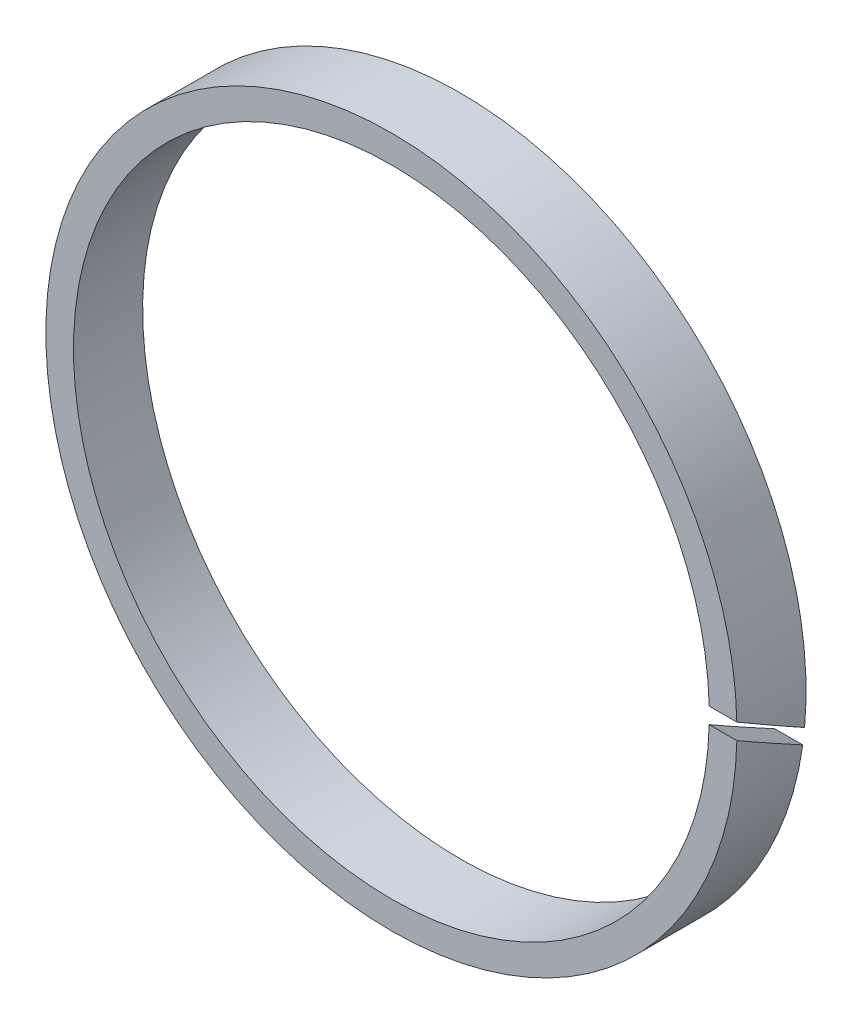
ISO-10303-21;
HEADER;
FILE_DESCRIPTION(('STEP AP214'),'2;1');
FILE_NAME('part.step','',(''),(''),'','','');
FILE_SCHEMA(('AUTOMOTIVE_DESIGN { 1 0 10303 214 1 1 1 1 }'));
ENDSEC;
DATA;
#1=APPLICATION_CONTEXT('core data for automotive mechanical design processes');
#2=APPLICATION_PROTOCOL_DEFINITION('international standard','automotive_design',2000,#1);
#3=PRODUCT_CONTEXT('',#1,'mechanical');
#4=PRODUCT('Part','Part','',(#3));
#5=PRODUCT_RELATED_PRODUCT_CATEGORY('part','',(#4));
#6=PRODUCT_DEFINITION_FORMATION('','',#4);
#7=PRODUCT_DEFINITION_CONTEXT('part definition',#1,'design');
#8=PRODUCT_DEFINITION('design','',#6,#7);
#9=PRODUCT_DEFINITION_SHAPE('','',#8);
#10=(LENGTH_UNIT() NAMED_UNIT(*) SI_UNIT(.MILLI.,.METRE.));
#11=(NAMED_UNIT(*) PLANE_ANGLE_UNIT() SI_UNIT($,.RADIAN.));
#12=(NAMED_UNIT(*) SI_UNIT($,.STERADIAN.) SOLID_ANGLE_UNIT());
#13=UNCERTAINTY_MEASURE_WITH_UNIT(LENGTH_MEASURE(1.E-05),#10,'distance_accuracy_value','');
#14=(GEOMETRIC_REPRESENTATION_CONTEXT(3) GLOBAL_UNCERTAINTY_ASSIGNED_CONTEXT((#13)) GLOBAL_UNIT_ASSIGNED_CONTEXT((#10,
#11,#12)) REPRESENTATION_CONTEXT('',''));
#15=CARTESIAN_POINT('',(0.,0.,0.));
#16=DIRECTION('',(0.,0.,1.));
#17=DIRECTION('',(1.,0.,0.));
#18=AXIS2_PLACEMENT_3D('',#15,#16,#17);
#19=CARTESIAN_POINT('',(0.,0.,-5.));
#20=DIRECTION('',(0.,0.,1.));
#21=DIRECTION('',(1.,0.,0.));
#22=AXIS2_PLACEMENT_3D('',#19,#20,#21);
#23=CYLINDRICAL_SURFACE('',#22,25.);
#24=CARTESIAN_POINT('',(0.,0.,0.999999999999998));
#25=DIRECTION('',(0.,-0.866025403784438,0.500000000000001));
#26=DIRECTION('',(0.,0.500000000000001,0.866025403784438));
#27=AXIS2_PLACEMENT_3D('',#24,#25,#26);
#28=ELLIPSE('',#27,49.9999999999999,25.);
#29=CARTESIAN_POINT('',(24.9933324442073,-0.577350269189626,0.));
#30=VERTEX_POINT('',#29);
#31=CARTESIAN_POINT('',(24.7588368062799,-3.46410161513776,-5.));
#32=VERTEX_POINT('',#31);
#33=EDGE_CURVE('E407',#30,#32,#28,.F.);
#34=ORIENTED_EDGE('',*,*,#33,.F.);
#35=CARTESIAN_POINT('',(0.,0.,0.));
#36=DIRECTION('',(0.,0.,1.));
#37=DIRECTION('',(1.,0.,0.));
#38=AXIS2_PLACEMENT_3D('',#35,#36,#37);
#39=CIRCLE('',#38,25.);
#40=CARTESIAN_POINT('',(24.9933324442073,0.577350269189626,0.));
#41=VERTEX_POINT('',#40);
#42=EDGE_CURVE('E402',#41,#30,#39,.T.);
#43=ORIENTED_EDGE('',*,*,#42,.F.);
#44=CARTESIAN_POINT('',(0.,0.,-0.999999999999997));
#45=DIRECTION('',(0.,0.866025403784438,-0.500000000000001));
#46=DIRECTION('',(0.,0.500000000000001,0.866025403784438));
#47=AXIS2_PLACEMENT_3D('',#44,#45,#46);
#48=ELLIPSE('',#47,49.9999999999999,25.);
#49=CARTESIAN_POINT('',(24.8931048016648,-2.30940107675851,-5.));
#50=VERTEX_POINT('',#49);
#51=EDGE_CURVE('E399',#50,#41,#48,.F.);
#52=ORIENTED_EDGE('',*,*,#51,.F.);
#53=CARTESIAN_POINT('',(0.,0.,-5.));
#54=DIRECTION('',(0.,0.,1.));
#55=DIRECTION('',(1.,0.,0.));
#56=AXIS2_PLACEMENT_3D('',#53,#54,#55);
#57=CIRCLE('',#56,25.);
#58=EDGE_CURVE('E392',#50,#32,#57,.T.);
#59=ORIENTED_EDGE('',*,*,#58,.T.);
#60=EDGE_LOOP('',(#34,#43,#52,#59));
#61=FACE_BOUND('',#60,.T.);
#62=ADVANCED_FACE('F348',(#61),#23,.T.);
#63=CARTESIAN_POINT('',(0.,0.,-5.));
#64=DIRECTION('',(0.,0.,1.));
#65=DIRECTION('',(1.,0.,0.));
#66=AXIS2_PLACEMENT_3D('',#63,#64,#65);
#67=PLANE('',#66);
#68=CARTESIAN_POINT('',(0.,0.,-5.));
#69=DIRECTION('',(0.,0.,1.));
#70=DIRECTION('',(1.,0.,0.));
#71=AXIS2_PLACEMENT_3D('',#68,#69,#70);
#72=CIRCLE('',#71,23.);
#73=CARTESIAN_POINT('',(22.8837642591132,-2.30940107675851,-5.));
#74=VERTEX_POINT('',#73);
#75=CARTESIAN_POINT('',(22.7376340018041,-3.46410161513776,-5.));
#76=VERTEX_POINT('',#75);
#77=EDGE_CURVE('E397',#74,#76,#72,.T.);
#78=ORIENTED_EDGE('',*,*,#77,.T.);
#79=DIRECTION('',(1.,0.,0.));
#80=VECTOR('',#79,1.);
#81=CARTESIAN_POINT('',(0.,-3.46410161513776,-5.));
#82=LINE('',#81,#80);
#83=EDGE_CURVE('E370',#76,#32,#82,.T.);
#84=ORIENTED_EDGE('',*,*,#83,.T.);
#85=ORIENTED_EDGE('',*,*,#58,.F.);
#86=DIRECTION('',(-1.,0.,0.));
#87=VECTOR('',#86,1.);
#88=CARTESIAN_POINT('',(0.,-2.30940107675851,-5.));
#89=LINE('',#88,#87);
#90=EDGE_CURVE('E386',#50,#74,#89,.T.);
#91=ORIENTED_EDGE('',*,*,#90,.T.);
#92=EDGE_LOOP('',(#78,#84,#85,#91));
#93=FACE_BOUND('',#92,.T.);
#94=ADVANCED_FACE('F396',(#93),#67,.F.);
#95=CARTESIAN_POINT('',(0.,0.,0.));
#96=DIRECTION('',(0.,0.,1.));
#97=DIRECTION('',(1.,0.,0.));
#98=AXIS2_PLACEMENT_3D('',#95,#96,#97);
#99=PLANE('',#98);
#100=DIRECTION('',(1.,0.,0.));
#101=VECTOR('',#100,1.);
#102=CARTESIAN_POINT('',(0.,-0.577350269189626,0.));
#103=LINE('',#102,#101);
#104=CARTESIAN_POINT('',(22.9927524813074,-0.577350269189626,0.));
#105=VERTEX_POINT('',#104);
#106=EDGE_CURVE('E414',#105,#30,#103,.T.);
#107=ORIENTED_EDGE('',*,*,#106,.F.);
#108=CARTESIAN_POINT('',(0.,0.,0.));
#109=DIRECTION('',(0.,0.,1.));
#110=DIRECTION('',(1.,0.,0.));
#111=AXIS2_PLACEMENT_3D('',#108,#109,#110);
#112=CIRCLE('',#111,23.);
#113=CARTESIAN_POINT('',(22.9927524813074,0.577350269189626,0.));
#114=VERTEX_POINT('',#113);
#115=EDGE_CURVE('E403',#114,#105,#112,.T.);
#116=ORIENTED_EDGE('',*,*,#115,.F.);
#117=DIRECTION('',(-1.,0.,0.));
#118=VECTOR('',#117,1.);
#119=CARTESIAN_POINT('',(0.,0.577350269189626,0.));
#120=LINE('',#119,#118);
#121=EDGE_CURVE('E362',#41,#114,#120,.T.);
#122=ORIENTED_EDGE('',*,*,#121,.F.);
#123=ORIENTED_EDGE('',*,*,#42,.T.);
#124=EDGE_LOOP('',(#107,#116,#122,#123));
#125=FACE_BOUND('',#124,.T.);
#126=ADVANCED_FACE('F422',(#125),#99,.T.);
#127=CARTESIAN_POINT('',(0.,0.,-5.));
#128=DIRECTION('',(0.,0.,1.));
#129=DIRECTION('',(1.,0.,0.));
#130=AXIS2_PLACEMENT_3D('',#127,#128,#129);
#131=CYLINDRICAL_SURFACE('',#130,23.);
#132=ORIENTED_EDGE('',*,*,#115,.T.);
#133=CARTESIAN_POINT('',(0.,0.,0.999999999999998));
#134=DIRECTION('',(0.,-0.866025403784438,0.500000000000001));
#135=DIRECTION('',(0.,0.500000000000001,0.866025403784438));
#136=AXIS2_PLACEMENT_3D('',#133,#134,#135);
#137=ELLIPSE('',#136,45.9999999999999,23.);
#138=EDGE_CURVE('E11',#105,#76,#137,.F.);
#139=ORIENTED_EDGE('',*,*,#138,.T.);
#140=ORIENTED_EDGE('',*,*,#77,.F.);
#141=CARTESIAN_POINT('',(0.,0.,-0.999999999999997));
#142=DIRECTION('',(0.,0.866025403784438,-0.500000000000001));
#143=DIRECTION('',(0.,0.500000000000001,0.866025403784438));
#144=AXIS2_PLACEMENT_3D('',#141,#142,#143);
#145=ELLIPSE('',#144,45.9999999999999,23.);
#146=EDGE_CURVE('E355',#74,#114,#145,.F.);
#147=ORIENTED_EDGE('',*,*,#146,.T.);
#148=EDGE_LOOP('',(#132,#139,#140,#147));
#149=FACE_BOUND('',#148,.T.);
#150=ADVANCED_FACE('F401',(#149),#131,.F.);
#151=CARTESIAN_POINT('',(20.,1.15470053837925,1.));
#152=DIRECTION('',(0.,0.866025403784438,-0.500000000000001));
#153=DIRECTION('',(0.,0.500000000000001,0.866025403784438));
#154=AXIS2_PLACEMENT_3D('',#151,#152,#153);
#155=PLANE('',#154);
#156=ORIENTED_EDGE('',*,*,#51,.T.);
#157=ORIENTED_EDGE('',*,*,#121,.T.);
#158=ORIENTED_EDGE('',*,*,#146,.F.);
#159=ORIENTED_EDGE('',*,*,#90,.F.);
#160=EDGE_LOOP('',(#156,#157,#158,#159));
#161=FACE_BOUND('',#160,.T.);
#162=ADVANCED_FACE('F385',(#161),#155,.F.);
#163=CARTESIAN_POINT('',(20.,0.,1.));
#164=DIRECTION('',(0.,-0.866025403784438,0.500000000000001));
#165=DIRECTION('',(0.,-0.500000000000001,-0.866025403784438));
#166=AXIS2_PLACEMENT_3D('',#163,#164,#165);
#167=PLANE('',#166);
#168=ORIENTED_EDGE('',*,*,#33,.T.);
#169=ORIENTED_EDGE('',*,*,#83,.F.);
#170=ORIENTED_EDGE('',*,*,#138,.F.);
#171=ORIENTED_EDGE('',*,*,#106,.T.);
#172=EDGE_LOOP('',(#168,#169,#170,#171));
#173=FACE_BOUND('',#172,.T.);
#174=ADVANCED_FACE('F419',(#173),#167,.F.);
#175=CLOSED_SHELL('',(#62,#94,#126,#150,#162,#174));
#176=MANIFOLD_SOLID_BREP('B2',#175);
#177=ADVANCED_BREP_SHAPE_REPRESENTATION('',(#18,#176),#14);
#178=SHAPE_DEFINITION_REPRESENTATION(#9,#177);
ENDSEC;
END-ISO-10303-21;
